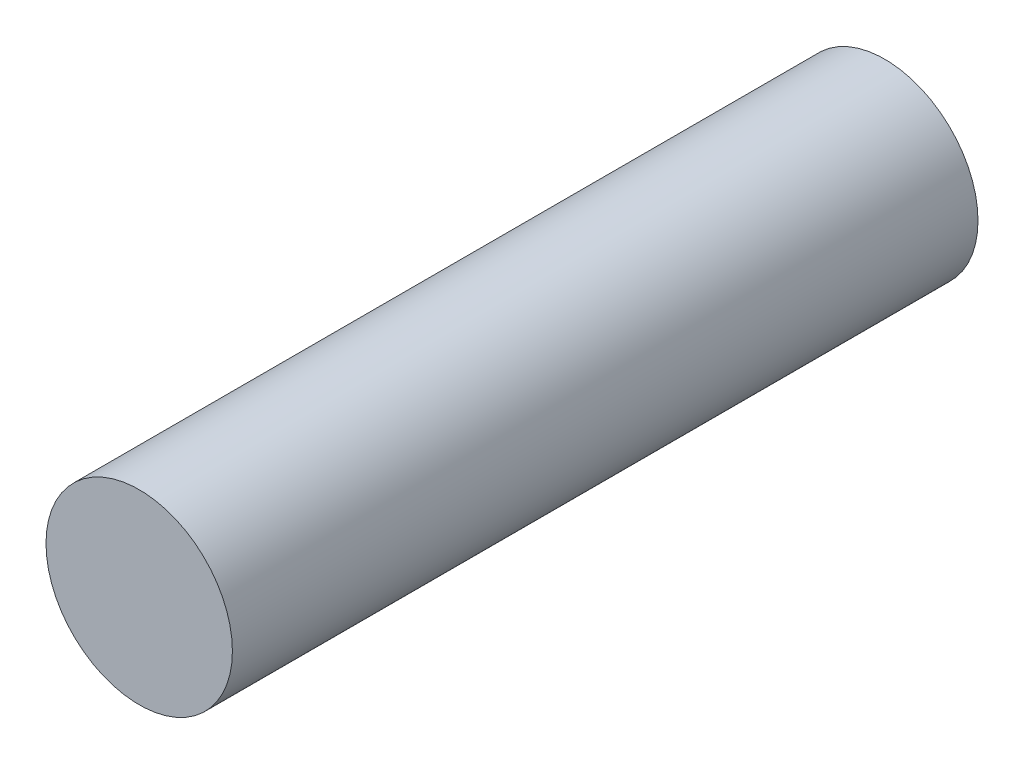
from build123d import *

# Parameters (mm, degrees)
ESBO_O1_R                = 0.75
RESSALTO_EXTRUS_O1_DEPTH = 6


with BuildPart() as part:
    # Esbo_o1 → Ressalto-extrus_o1 (new body)
    with BuildSketch(Plane.XY):
        Circle(ESBO_O1_R)
    extrude(amount=RESSALTO_EXTRUS_O1_DEPTH)


solid = part.part
